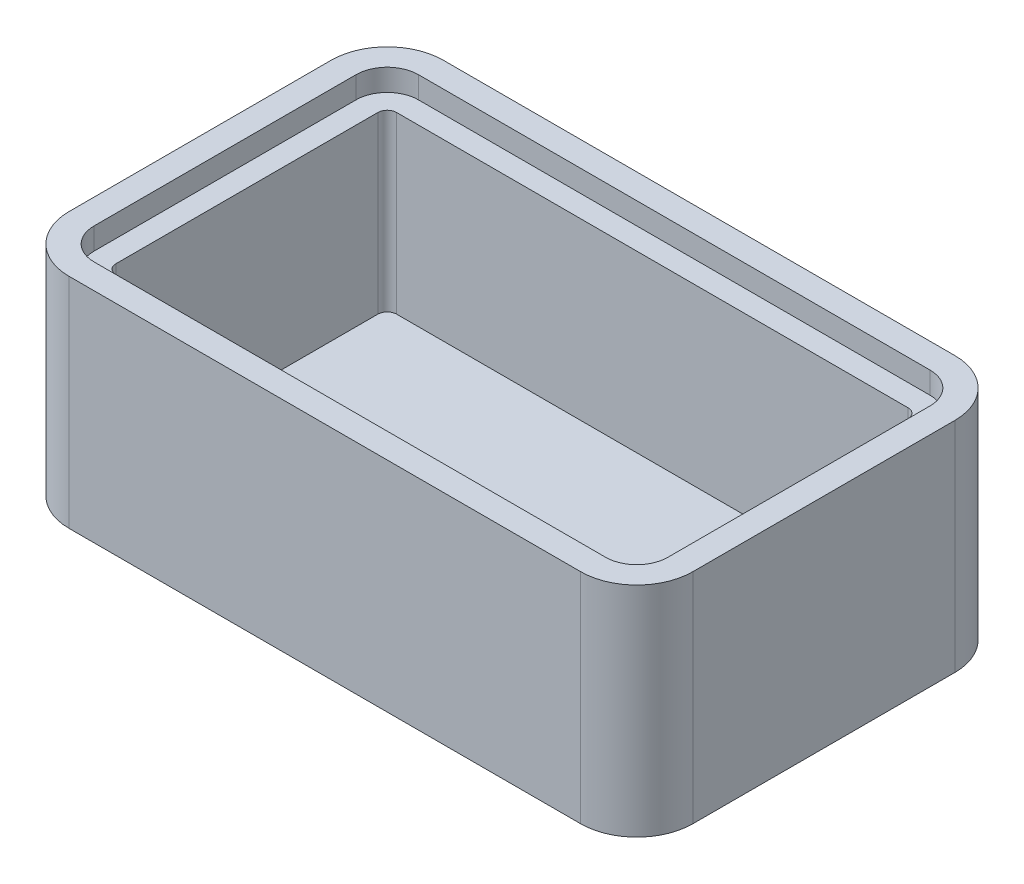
ISO-10303-21;
HEADER;
FILE_DESCRIPTION(('STEP AP214'),'2;1');
FILE_NAME('part.step','',(''),(''),'','','');
FILE_SCHEMA(('AUTOMOTIVE_DESIGN { 1 0 10303 214 1 1 1 1 }'));
ENDSEC;
DATA;
#1=APPLICATION_CONTEXT('core data for automotive mechanical design processes');
#2=APPLICATION_PROTOCOL_DEFINITION('international standard','automotive_design',2000,#1);
#3=PRODUCT_CONTEXT('',#1,'mechanical');
#4=PRODUCT('Part','Part','',(#3));
#5=PRODUCT_RELATED_PRODUCT_CATEGORY('part','',(#4));
#6=PRODUCT_DEFINITION_FORMATION('','',#4);
#7=PRODUCT_DEFINITION_CONTEXT('part definition',#1,'design');
#8=PRODUCT_DEFINITION('design','',#6,#7);
#9=PRODUCT_DEFINITION_SHAPE('','',#8);
#10=(LENGTH_UNIT() NAMED_UNIT(*) SI_UNIT(.MILLI.,.METRE.));
#11=(NAMED_UNIT(*) PLANE_ANGLE_UNIT() SI_UNIT($,.RADIAN.));
#12=(NAMED_UNIT(*) SI_UNIT($,.STERADIAN.) SOLID_ANGLE_UNIT());
#13=UNCERTAINTY_MEASURE_WITH_UNIT(LENGTH_MEASURE(1.E-05),#10,'distance_accuracy_value','');
#14=(GEOMETRIC_REPRESENTATION_CONTEXT(3) GLOBAL_UNCERTAINTY_ASSIGNED_CONTEXT((#13)) GLOBAL_UNIT_ASSIGNED_CONTEXT((#10,
#11,#12)) REPRESENTATION_CONTEXT('',''));
#15=CARTESIAN_POINT('',(0.,0.,0.));
#16=DIRECTION('',(0.,0.,1.));
#17=DIRECTION('',(1.,0.,0.));
#18=AXIS2_PLACEMENT_3D('',#15,#16,#17);
#19=CARTESIAN_POINT('',(0.,44.45,0.));
#20=DIRECTION('',(1.,0.,0.));
#21=DIRECTION('',(0.,0.,-1.));
#22=AXIS2_PLACEMENT_3D('',#19,#20,#21);
#23=PLANE('',#22);
#24=DIRECTION('',(0.,0.,1.));
#25=VECTOR('',#24,1.);
#26=CARTESIAN_POINT('',(0.,44.45,0.));
#27=LINE('',#26,#25);
#28=CARTESIAN_POINT('',(0.,44.45,-64.77));
#29=VERTEX_POINT('',#28);
#30=CARTESIAN_POINT('',(0.,44.45,-11.43));
#31=VERTEX_POINT('',#30);
#32=EDGE_CURVE('E323',#29,#31,#27,.T.);
#33=ORIENTED_EDGE('',*,*,#32,.F.);
#34=DIRECTION('',(0.,-1.,0.));
#35=VECTOR('',#34,1.);
#36=CARTESIAN_POINT('',(0.,44.45,-64.77));
#37=LINE('',#36,#35);
#38=CARTESIAN_POINT('',(0.,0.,-64.77));
#39=VERTEX_POINT('',#38);
#40=EDGE_CURVE('E12',#29,#39,#37,.T.);
#41=ORIENTED_EDGE('',*,*,#40,.T.);
#42=DIRECTION('',(0.,0.,1.));
#43=VECTOR('',#42,1.);
#44=CARTESIAN_POINT('',(0.,0.,0.));
#45=LINE('',#44,#43);
#46=CARTESIAN_POINT('',(0.,0.,-11.43));
#47=VERTEX_POINT('',#46);
#48=EDGE_CURVE('E298',#39,#47,#45,.T.);
#49=ORIENTED_EDGE('',*,*,#48,.T.);
#50=DIRECTION('',(0.,-1.,0.));
#51=VECTOR('',#50,1.);
#52=CARTESIAN_POINT('',(0.,44.45,-11.43));
#53=LINE('',#52,#51);
#54=EDGE_CURVE('E38',#47,#31,#53,.F.);
#55=ORIENTED_EDGE('',*,*,#54,.T.);
#56=EDGE_LOOP('',(#33,#41,#49,#55));
#57=FACE_BOUND('',#56,.T.);
#58=ADVANCED_FACE('F31',(#57),#23,.F.);
#59=CARTESIAN_POINT('',(0.,44.45,0.));
#60=DIRECTION('',(0.,0.,-1.));
#61=DIRECTION('',(-1.,0.,0.));
#62=AXIS2_PLACEMENT_3D('',#59,#60,#61);
#63=PLANE('',#62);
#64=DIRECTION('',(1.,0.,0.));
#65=VECTOR('',#64,1.);
#66=CARTESIAN_POINT('',(0.,0.,0.));
#67=LINE('',#66,#65);
#68=CARTESIAN_POINT('',(11.43,0.,0.));
#69=VERTEX_POINT('',#68);
#70=CARTESIAN_POINT('',(115.57,0.,0.));
#71=VERTEX_POINT('',#70);
#72=EDGE_CURVE('E314',#69,#71,#67,.T.);
#73=ORIENTED_EDGE('',*,*,#72,.T.);
#74=DIRECTION('',(0.,-1.,0.));
#75=VECTOR('',#74,1.);
#76=CARTESIAN_POINT('',(115.57,44.45,0.));
#77=LINE('',#76,#75);
#78=CARTESIAN_POINT('',(115.57,44.45,0.));
#79=VERTEX_POINT('',#78);
#80=EDGE_CURVE('E364',#71,#79,#77,.F.);
#81=ORIENTED_EDGE('',*,*,#80,.T.);
#82=DIRECTION('',(1.,0.,0.));
#83=VECTOR('',#82,1.);
#84=CARTESIAN_POINT('',(0.,44.45,0.));
#85=LINE('',#84,#83);
#86=CARTESIAN_POINT('',(11.43,44.45,0.));
#87=VERTEX_POINT('',#86);
#88=EDGE_CURVE('E326',#87,#79,#85,.T.);
#89=ORIENTED_EDGE('',*,*,#88,.F.);
#90=DIRECTION('',(0.,-1.,0.));
#91=VECTOR('',#90,1.);
#92=CARTESIAN_POINT('',(11.43,44.45,0.));
#93=LINE('',#92,#91);
#94=EDGE_CURVE('E361',#87,#69,#93,.T.);
#95=ORIENTED_EDGE('',*,*,#94,.T.);
#96=EDGE_LOOP('',(#73,#81,#89,#95));
#97=FACE_BOUND('',#96,.T.);
#98=ADVANCED_FACE('F380',(#97),#63,.F.);
#99=CARTESIAN_POINT('',(127.,44.45,0.));
#100=DIRECTION('',(-1.,0.,0.));
#101=DIRECTION('',(0.,0.,1.));
#102=AXIS2_PLACEMENT_3D('',#99,#100,#101);
#103=PLANE('',#102);
#104=DIRECTION('',(0.,0.,-1.));
#105=VECTOR('',#104,1.);
#106=CARTESIAN_POINT('',(127.,0.,0.));
#107=LINE('',#106,#105);
#108=CARTESIAN_POINT('',(127.,0.,-11.43));
#109=VERTEX_POINT('',#108);
#110=CARTESIAN_POINT('',(127.,0.,-64.77));
#111=VERTEX_POINT('',#110);
#112=EDGE_CURVE('E317',#109,#111,#107,.T.);
#113=ORIENTED_EDGE('',*,*,#112,.T.);
#114=DIRECTION('',(0.,-1.,0.));
#115=VECTOR('',#114,1.);
#116=CARTESIAN_POINT('',(127.,44.45,-64.77));
#117=LINE('',#116,#115);
#118=CARTESIAN_POINT('',(127.,44.45,-64.77));
#119=VERTEX_POINT('',#118);
#120=EDGE_CURVE('E351',#111,#119,#117,.F.);
#121=ORIENTED_EDGE('',*,*,#120,.T.);
#122=DIRECTION('',(0.,0.,-1.));
#123=VECTOR('',#122,1.);
#124=CARTESIAN_POINT('',(127.,44.45,0.));
#125=LINE('',#124,#123);
#126=CARTESIAN_POINT('',(127.,44.45,-11.43));
#127=VERTEX_POINT('',#126);
#128=EDGE_CURVE('E329',#127,#119,#125,.T.);
#129=ORIENTED_EDGE('',*,*,#128,.F.);
#130=DIRECTION('',(0.,-1.,0.));
#131=VECTOR('',#130,1.);
#132=CARTESIAN_POINT('',(127.,44.45,-11.43));
#133=LINE('',#132,#131);
#134=EDGE_CURVE('E348',#127,#109,#133,.T.);
#135=ORIENTED_EDGE('',*,*,#134,.T.);
#136=EDGE_LOOP('',(#113,#121,#129,#135));
#137=FACE_BOUND('',#136,.T.);
#138=ADVANCED_FACE('F392',(#137),#103,.F.);
#139=CARTESIAN_POINT('',(0.,44.45,-76.2));
#140=DIRECTION('',(0.,0.,1.));
#141=DIRECTION('',(1.,0.,0.));
#142=AXIS2_PLACEMENT_3D('',#139,#140,#141);
#143=PLANE('',#142);
#144=DIRECTION('',(-1.,0.,0.));
#145=VECTOR('',#144,1.);
#146=CARTESIAN_POINT('',(0.,44.45,-76.2));
#147=LINE('',#146,#145);
#148=CARTESIAN_POINT('',(115.57,44.45,-76.2));
#149=VERTEX_POINT('',#148);
#150=CARTESIAN_POINT('',(11.43,44.45,-76.2));
#151=VERTEX_POINT('',#150);
#152=EDGE_CURVE('E332',#149,#151,#147,.T.);
#153=ORIENTED_EDGE('',*,*,#152,.F.);
#154=DIRECTION('',(0.,-1.,0.));
#155=VECTOR('',#154,1.);
#156=CARTESIAN_POINT('',(115.57,44.45,-76.2));
#157=LINE('',#156,#155);
#158=CARTESIAN_POINT('',(115.57,0.,-76.2));
#159=VERTEX_POINT('',#158);
#160=EDGE_CURVE('E337',#149,#159,#157,.T.);
#161=ORIENTED_EDGE('',*,*,#160,.T.);
#162=DIRECTION('',(-1.,0.,0.));
#163=VECTOR('',#162,1.);
#164=CARTESIAN_POINT('',(0.,0.,-76.2));
#165=LINE('',#164,#163);
#166=CARTESIAN_POINT('',(11.43,0.,-76.2));
#167=VERTEX_POINT('',#166);
#168=EDGE_CURVE('E320',#159,#167,#165,.T.);
#169=ORIENTED_EDGE('',*,*,#168,.T.);
#170=DIRECTION('',(0.,-1.,0.));
#171=VECTOR('',#170,1.);
#172=CARTESIAN_POINT('',(11.43,44.45,-76.2));
#173=LINE('',#172,#171);
#174=EDGE_CURVE('E335',#167,#151,#173,.F.);
#175=ORIENTED_EDGE('',*,*,#174,.T.);
#176=EDGE_LOOP('',(#153,#161,#169,#175));
#177=FACE_BOUND('',#176,.T.);
#178=ADVANCED_FACE('F400',(#177),#143,.F.);
#179=CARTESIAN_POINT('',(0.,44.45,-76.2));
#180=DIRECTION('',(0.,-1.,0.));
#181=DIRECTION('',(0.,0.,-1.));
#182=AXIS2_PLACEMENT_3D('',#179,#180,#181);
#183=PLANE('',#182);
#184=DIRECTION('',(0.,0.,-1.));
#185=VECTOR('',#184,1.);
#186=CARTESIAN_POINT('',(121.92,44.45,-11.43));
#187=LINE('',#186,#185);
#188=CARTESIAN_POINT('',(121.92,44.45,-11.43));
#189=VERTEX_POINT('',#188);
#190=CARTESIAN_POINT('',(121.92,44.45,-64.77));
#191=VERTEX_POINT('',#190);
#192=EDGE_CURVE('E250',#189,#191,#187,.T.);
#193=ORIENTED_EDGE('',*,*,#192,.F.);
#194=CARTESIAN_POINT('',(115.57,44.45,-11.43));
#195=DIRECTION('',(0.,1.,0.));
#196=DIRECTION('',(0.,0.,1.));
#197=AXIS2_PLACEMENT_3D('',#194,#195,#196);
#198=CIRCLE('',#197,6.35);
#199=CARTESIAN_POINT('',(115.57,44.45,-5.08));
#200=VERTEX_POINT('',#199);
#201=EDGE_CURVE('E53',#200,#189,#198,.T.);
#202=ORIENTED_EDGE('',*,*,#201,.F.);
#203=DIRECTION('',(1.,0.,0.));
#204=VECTOR('',#203,1.);
#205=CARTESIAN_POINT('',(11.43,44.45,-5.08));
#206=LINE('',#205,#204);
#207=CARTESIAN_POINT('',(11.43,44.45,-5.08));
#208=VERTEX_POINT('',#207);
#209=EDGE_CURVE('E268',#208,#200,#206,.T.);
#210=ORIENTED_EDGE('',*,*,#209,.F.);
#211=CARTESIAN_POINT('',(11.43,44.45,-11.43));
#212=DIRECTION('',(0.,1.,0.));
#213=DIRECTION('',(0.,0.,1.));
#214=AXIS2_PLACEMENT_3D('',#211,#212,#213);
#215=CIRCLE('',#214,6.35);
#216=CARTESIAN_POINT('',(5.08,44.45,-11.43));
#217=VERTEX_POINT('',#216);
#218=EDGE_CURVE('E265',#217,#208,#215,.T.);
#219=ORIENTED_EDGE('',*,*,#218,.F.);
#220=DIRECTION('',(0.,0.,1.));
#221=VECTOR('',#220,1.);
#222=CARTESIAN_POINT('',(5.08,44.45,-64.77));
#223=LINE('',#222,#221);
#224=CARTESIAN_POINT('',(5.08,44.45,-64.77));
#225=VERTEX_POINT('',#224);
#226=EDGE_CURVE('E262',#225,#217,#223,.T.);
#227=ORIENTED_EDGE('',*,*,#226,.F.);
#228=CARTESIAN_POINT('',(11.43,44.45,-64.77));
#229=DIRECTION('',(0.,1.,0.));
#230=DIRECTION('',(0.,0.,1.));
#231=AXIS2_PLACEMENT_3D('',#228,#229,#230);
#232=CIRCLE('',#231,6.35);
#233=CARTESIAN_POINT('',(11.43,44.45,-71.12));
#234=VERTEX_POINT('',#233);
#235=EDGE_CURVE('E259',#234,#225,#232,.T.);
#236=ORIENTED_EDGE('',*,*,#235,.F.);
#237=DIRECTION('',(-1.,0.,0.));
#238=VECTOR('',#237,1.);
#239=CARTESIAN_POINT('',(115.57,44.45,-71.12));
#240=LINE('',#239,#238);
#241=CARTESIAN_POINT('',(115.57,44.45,-71.12));
#242=VERTEX_POINT('',#241);
#243=EDGE_CURVE('E256',#242,#234,#240,.T.);
#244=ORIENTED_EDGE('',*,*,#243,.F.);
#245=CARTESIAN_POINT('',(115.57,44.45,-64.77));
#246=DIRECTION('',(0.,1.,0.));
#247=DIRECTION('',(0.,0.,1.));
#248=AXIS2_PLACEMENT_3D('',#245,#246,#247);
#249=CIRCLE('',#248,6.34999999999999);
#250=EDGE_CURVE('E253',#191,#242,#249,.T.);
#251=ORIENTED_EDGE('',*,*,#250,.F.);
#252=EDGE_LOOP('',(#193,#202,#210,#219,#227,#236,#244,#251));
#253=FACE_BOUND('',#252,.T.);
#254=ORIENTED_EDGE('',*,*,#128,.T.);
#255=CARTESIAN_POINT('',(115.57,44.45,-64.77));
#256=DIRECTION('',(0.,-1.,0.));
#257=DIRECTION('',(0.,0.,-1.));
#258=AXIS2_PLACEMENT_3D('',#255,#256,#257);
#259=CIRCLE('',#258,11.43);
#260=EDGE_CURVE('E359',#119,#149,#259,.F.);
#261=ORIENTED_EDGE('',*,*,#260,.T.);
#262=ORIENTED_EDGE('',*,*,#152,.T.);
#263=CARTESIAN_POINT('',(11.43,44.45,-64.77));
#264=DIRECTION('',(0.,-1.,0.));
#265=DIRECTION('',(0.,0.,-1.));
#266=AXIS2_PLACEMENT_3D('',#263,#264,#265);
#267=CIRCLE('',#266,11.43);
#268=EDGE_CURVE('E355',#151,#29,#267,.F.);
#269=ORIENTED_EDGE('',*,*,#268,.T.);
#270=ORIENTED_EDGE('',*,*,#32,.T.);
#271=CARTESIAN_POINT('',(11.43,44.45,-11.43));
#272=DIRECTION('',(0.,-1.,0.));
#273=DIRECTION('',(0.,0.,-1.));
#274=AXIS2_PLACEMENT_3D('',#271,#272,#273);
#275=CIRCLE('',#274,11.43);
#276=EDGE_CURVE('E353',#31,#87,#275,.F.);
#277=ORIENTED_EDGE('',*,*,#276,.T.);
#278=ORIENTED_EDGE('',*,*,#88,.T.);
#279=CARTESIAN_POINT('',(115.57,44.45,-11.43));
#280=DIRECTION('',(0.,-1.,0.));
#281=DIRECTION('',(0.,0.,-1.));
#282=AXIS2_PLACEMENT_3D('',#279,#280,#281);
#283=CIRCLE('',#282,11.43);
#284=EDGE_CURVE('E357',#79,#127,#283,.F.);
#285=ORIENTED_EDGE('',*,*,#284,.T.);
#286=EDGE_LOOP('',(#254,#261,#262,#269,#270,#277,#278,#285));
#287=FACE_BOUND('',#286,.T.);
#288=ADVANCED_FACE('F373',(#253,#287),#183,.F.);
#289=CARTESIAN_POINT('',(0.,0.,-76.2));
#290=DIRECTION('',(0.,-1.,0.));
#291=DIRECTION('',(0.,0.,-1.));
#292=AXIS2_PLACEMENT_3D('',#289,#290,#291);
#293=PLANE('',#292);
#294=ORIENTED_EDGE('',*,*,#168,.F.);
#295=CARTESIAN_POINT('',(115.57,0.,-64.77));
#296=DIRECTION('',(0.,-1.,0.));
#297=DIRECTION('',(0.,0.,-1.));
#298=AXIS2_PLACEMENT_3D('',#295,#296,#297);
#299=CIRCLE('',#298,11.43);
#300=EDGE_CURVE('E346',#159,#111,#299,.T.);
#301=ORIENTED_EDGE('',*,*,#300,.T.);
#302=ORIENTED_EDGE('',*,*,#112,.F.);
#303=CARTESIAN_POINT('',(115.57,0.,-11.43));
#304=DIRECTION('',(0.,-1.,0.));
#305=DIRECTION('',(0.,0.,-1.));
#306=AXIS2_PLACEMENT_3D('',#303,#304,#305);
#307=CIRCLE('',#306,11.43);
#308=EDGE_CURVE('E344',#109,#71,#307,.T.);
#309=ORIENTED_EDGE('',*,*,#308,.T.);
#310=ORIENTED_EDGE('',*,*,#72,.F.);
#311=CARTESIAN_POINT('',(11.43,0.,-11.43));
#312=DIRECTION('',(0.,-1.,0.));
#313=DIRECTION('',(0.,0.,-1.));
#314=AXIS2_PLACEMENT_3D('',#311,#312,#313);
#315=CIRCLE('',#314,11.43);
#316=EDGE_CURVE('E340',#69,#47,#315,.T.);
#317=ORIENTED_EDGE('',*,*,#316,.T.);
#318=ORIENTED_EDGE('',*,*,#48,.F.);
#319=CARTESIAN_POINT('',(11.43,0.,-64.77));
#320=DIRECTION('',(0.,-1.,0.));
#321=DIRECTION('',(0.,0.,-1.));
#322=AXIS2_PLACEMENT_3D('',#319,#320,#321);
#323=CIRCLE('',#322,11.43);
#324=EDGE_CURVE('E342',#39,#167,#323,.T.);
#325=ORIENTED_EDGE('',*,*,#324,.T.);
#326=EDGE_LOOP('',(#294,#301,#302,#309,#310,#317,#318,#325));
#327=FACE_BOUND('',#326,.T.);
#328=ADVANCED_FACE('F384',(#327),#293,.T.);
#329=CARTESIAN_POINT('',(115.57,44.45,-64.77));
#330=DIRECTION('',(0.,-1.,0.));
#331=DIRECTION('',(0.,0.,-1.));
#332=AXIS2_PLACEMENT_3D('',#329,#330,#331);
#333=CYLINDRICAL_SURFACE('',#332,11.43);
#334=ORIENTED_EDGE('',*,*,#260,.F.);
#335=ORIENTED_EDGE('',*,*,#120,.F.);
#336=ORIENTED_EDGE('',*,*,#300,.F.);
#337=ORIENTED_EDGE('',*,*,#160,.F.);
#338=EDGE_LOOP('',(#334,#335,#336,#337));
#339=FACE_BOUND('',#338,.T.);
#340=ADVANCED_FACE('F398',(#339),#333,.T.);
#341=CARTESIAN_POINT('',(115.57,44.45,-11.43));
#342=DIRECTION('',(0.,-1.,0.));
#343=DIRECTION('',(0.,0.,-1.));
#344=AXIS2_PLACEMENT_3D('',#341,#342,#343);
#345=CYLINDRICAL_SURFACE('',#344,11.43);
#346=ORIENTED_EDGE('',*,*,#284,.F.);
#347=ORIENTED_EDGE('',*,*,#80,.F.);
#348=ORIENTED_EDGE('',*,*,#308,.F.);
#349=ORIENTED_EDGE('',*,*,#134,.F.);
#350=EDGE_LOOP('',(#346,#347,#348,#349));
#351=FACE_BOUND('',#350,.T.);
#352=ADVANCED_FACE('F389',(#351),#345,.T.);
#353=CARTESIAN_POINT('',(11.43,44.45,-64.77));
#354=DIRECTION('',(0.,-1.,0.));
#355=DIRECTION('',(0.,0.,-1.));
#356=AXIS2_PLACEMENT_3D('',#353,#354,#355);
#357=CYLINDRICAL_SURFACE('',#356,11.43);
#358=ORIENTED_EDGE('',*,*,#268,.F.);
#359=ORIENTED_EDGE('',*,*,#174,.F.);
#360=ORIENTED_EDGE('',*,*,#324,.F.);
#361=ORIENTED_EDGE('',*,*,#40,.F.);
#362=EDGE_LOOP('',(#358,#359,#360,#361));
#363=FACE_BOUND('',#362,.T.);
#364=ADVANCED_FACE('F403',(#363),#357,.T.);
#365=CARTESIAN_POINT('',(11.43,44.45,-11.43));
#366=DIRECTION('',(0.,-1.,0.));
#367=DIRECTION('',(0.,0.,-1.));
#368=AXIS2_PLACEMENT_3D('',#365,#366,#367);
#369=CYLINDRICAL_SURFACE('',#368,11.43);
#370=ORIENTED_EDGE('',*,*,#276,.F.);
#371=ORIENTED_EDGE('',*,*,#54,.F.);
#372=ORIENTED_EDGE('',*,*,#316,.F.);
#373=ORIENTED_EDGE('',*,*,#94,.F.);
#374=EDGE_LOOP('',(#370,#371,#372,#373));
#375=FACE_BOUND('',#374,.T.);
#376=ADVANCED_FACE('F377',(#375),#369,.T.);
#377=CARTESIAN_POINT('',(115.57,40.005,-11.43));
#378=DIRECTION('',(0.,1.,0.));
#379=DIRECTION('',(0.,0.,1.));
#380=AXIS2_PLACEMENT_3D('',#377,#378,#379);
#381=CYLINDRICAL_SURFACE('',#380,6.35);
#382=ORIENTED_EDGE('',*,*,#201,.T.);
#383=DIRECTION('',(0.,1.,0.));
#384=VECTOR('',#383,1.);
#385=CARTESIAN_POINT('',(121.92,40.005,-11.43));
#386=LINE('',#385,#384);
#387=CARTESIAN_POINT('',(121.92,40.005,-11.43));
#388=VERTEX_POINT('',#387);
#389=EDGE_CURVE('E295',#388,#189,#386,.T.);
#390=ORIENTED_EDGE('',*,*,#389,.F.);
#391=CARTESIAN_POINT('',(115.57,40.005,-11.43));
#392=DIRECTION('',(0.,1.,0.));
#393=DIRECTION('',(0.,0.,1.));
#394=AXIS2_PLACEMENT_3D('',#391,#392,#393);
#395=CIRCLE('',#394,6.35);
#396=CARTESIAN_POINT('',(115.57,40.005,-5.08));
#397=VERTEX_POINT('',#396);
#398=EDGE_CURVE('E271',#397,#388,#395,.T.);
#399=ORIENTED_EDGE('',*,*,#398,.F.);
#400=DIRECTION('',(0.,1.,0.));
#401=VECTOR('',#400,1.);
#402=CARTESIAN_POINT('',(115.57,40.005,-5.08));
#403=LINE('',#402,#401);
#404=EDGE_CURVE('E296',#397,#200,#403,.T.);
#405=ORIENTED_EDGE('',*,*,#404,.T.);
#406=EDGE_LOOP('',(#382,#390,#399,#405));
#407=FACE_BOUND('',#406,.T.);
#408=ADVANCED_FACE('F410',(#407),#381,.F.);
#409=CARTESIAN_POINT('',(11.43,40.005,-5.08));
#410=DIRECTION('',(0.,0.,1.));
#411=DIRECTION('',(1.,0.,0.));
#412=AXIS2_PLACEMENT_3D('',#409,#410,#411);
#413=PLANE('',#412);
#414=ORIENTED_EDGE('',*,*,#209,.T.);
#415=ORIENTED_EDGE('',*,*,#404,.F.);
#416=DIRECTION('',(1.,0.,0.));
#417=VECTOR('',#416,1.);
#418=CARTESIAN_POINT('',(11.43,40.005,-5.08));
#419=LINE('',#418,#417);
#420=CARTESIAN_POINT('',(11.43,40.005,-5.08));
#421=VERTEX_POINT('',#420);
#422=EDGE_CURVE('E292',#421,#397,#419,.T.);
#423=ORIENTED_EDGE('',*,*,#422,.F.);
#424=DIRECTION('',(0.,1.,0.));
#425=VECTOR('',#424,1.);
#426=CARTESIAN_POINT('',(11.43,40.005,-5.08));
#427=LINE('',#426,#425);
#428=EDGE_CURVE('E299',#421,#208,#427,.T.);
#429=ORIENTED_EDGE('',*,*,#428,.T.);
#430=EDGE_LOOP('',(#414,#415,#423,#429));
#431=FACE_BOUND('',#430,.T.);
#432=ADVANCED_FACE('F451',(#431),#413,.F.);
#433=CARTESIAN_POINT('',(11.43,40.005,-11.43));
#434=DIRECTION('',(0.,1.,0.));
#435=DIRECTION('',(0.,0.,1.));
#436=AXIS2_PLACEMENT_3D('',#433,#434,#435);
#437=CYLINDRICAL_SURFACE('',#436,6.35);
#438=ORIENTED_EDGE('',*,*,#218,.T.);
#439=ORIENTED_EDGE('',*,*,#428,.F.);
#440=CARTESIAN_POINT('',(11.43,40.005,-11.43));
#441=DIRECTION('',(0.,1.,0.));
#442=DIRECTION('',(0.,0.,1.));
#443=AXIS2_PLACEMENT_3D('',#440,#441,#442);
#444=CIRCLE('',#443,6.35);
#445=CARTESIAN_POINT('',(5.08,40.005,-11.43));
#446=VERTEX_POINT('',#445);
#447=EDGE_CURVE('E289',#446,#421,#444,.T.);
#448=ORIENTED_EDGE('',*,*,#447,.F.);
#449=DIRECTION('',(0.,1.,0.));
#450=VECTOR('',#449,1.);
#451=CARTESIAN_POINT('',(5.08,40.005,-11.43));
#452=LINE('',#451,#450);
#453=EDGE_CURVE('E301',#446,#217,#452,.T.);
#454=ORIENTED_EDGE('',*,*,#453,.T.);
#455=EDGE_LOOP('',(#438,#439,#448,#454));
#456=FACE_BOUND('',#455,.T.);
#457=ADVANCED_FACE('F458',(#456),#437,.F.);
#458=CARTESIAN_POINT('',(5.08,40.005,-64.77));
#459=DIRECTION('',(-1.,0.,0.));
#460=DIRECTION('',(0.,0.,1.));
#461=AXIS2_PLACEMENT_3D('',#458,#459,#460);
#462=PLANE('',#461);
#463=ORIENTED_EDGE('',*,*,#226,.T.);
#464=ORIENTED_EDGE('',*,*,#453,.F.);
#465=DIRECTION('',(0.,0.,1.));
#466=VECTOR('',#465,1.);
#467=CARTESIAN_POINT('',(5.08,40.005,-64.77));
#468=LINE('',#467,#466);
#469=CARTESIAN_POINT('',(5.08,40.005,-64.77));
#470=VERTEX_POINT('',#469);
#471=EDGE_CURVE('E286',#470,#446,#468,.T.);
#472=ORIENTED_EDGE('',*,*,#471,.F.);
#473=DIRECTION('',(0.,1.,0.));
#474=VECTOR('',#473,1.);
#475=CARTESIAN_POINT('',(5.08,40.005,-64.77));
#476=LINE('',#475,#474);
#477=EDGE_CURVE('E303',#470,#225,#476,.T.);
#478=ORIENTED_EDGE('',*,*,#477,.T.);
#479=EDGE_LOOP('',(#463,#464,#472,#478));
#480=FACE_BOUND('',#479,.T.);
#481=ADVANCED_FACE('F466',(#480),#462,.F.);
#482=CARTESIAN_POINT('',(11.43,40.005,-64.77));
#483=DIRECTION('',(0.,1.,0.));
#484=DIRECTION('',(0.,0.,1.));
#485=AXIS2_PLACEMENT_3D('',#482,#483,#484);
#486=CYLINDRICAL_SURFACE('',#485,6.35);
#487=ORIENTED_EDGE('',*,*,#235,.T.);
#488=ORIENTED_EDGE('',*,*,#477,.F.);
#489=CARTESIAN_POINT('',(11.43,40.005,-64.77));
#490=DIRECTION('',(0.,1.,0.));
#491=DIRECTION('',(0.,0.,1.));
#492=AXIS2_PLACEMENT_3D('',#489,#490,#491);
#493=CIRCLE('',#492,6.35);
#494=CARTESIAN_POINT('',(11.43,40.005,-71.12));
#495=VERTEX_POINT('',#494);
#496=EDGE_CURVE('E283',#495,#470,#493,.T.);
#497=ORIENTED_EDGE('',*,*,#496,.F.);
#498=DIRECTION('',(0.,1.,0.));
#499=VECTOR('',#498,1.);
#500=CARTESIAN_POINT('',(11.43,40.005,-71.12));
#501=LINE('',#500,#499);
#502=EDGE_CURVE('E305',#495,#234,#501,.T.);
#503=ORIENTED_EDGE('',*,*,#502,.T.);
#504=EDGE_LOOP('',(#487,#488,#497,#503));
#505=FACE_BOUND('',#504,.T.);
#506=ADVANCED_FACE('F474',(#505),#486,.F.);
#507=CARTESIAN_POINT('',(115.57,40.005,-71.12));
#508=DIRECTION('',(0.,0.,-1.));
#509=DIRECTION('',(-1.,0.,0.));
#510=AXIS2_PLACEMENT_3D('',#507,#508,#509);
#511=PLANE('',#510);
#512=ORIENTED_EDGE('',*,*,#243,.T.);
#513=ORIENTED_EDGE('',*,*,#502,.F.);
#514=DIRECTION('',(-1.,0.,0.));
#515=VECTOR('',#514,1.);
#516=CARTESIAN_POINT('',(115.57,40.005,-71.12));
#517=LINE('',#516,#515);
#518=CARTESIAN_POINT('',(115.57,40.005,-71.12));
#519=VERTEX_POINT('',#518);
#520=EDGE_CURVE('E280',#519,#495,#517,.T.);
#521=ORIENTED_EDGE('',*,*,#520,.F.);
#522=DIRECTION('',(0.,1.,0.));
#523=VECTOR('',#522,1.);
#524=CARTESIAN_POINT('',(115.57,40.005,-71.12));
#525=LINE('',#524,#523);
#526=EDGE_CURVE('E307',#519,#242,#525,.T.);
#527=ORIENTED_EDGE('',*,*,#526,.T.);
#528=EDGE_LOOP('',(#512,#513,#521,#527));
#529=FACE_BOUND('',#528,.T.);
#530=ADVANCED_FACE('F482',(#529),#511,.F.);
#531=CARTESIAN_POINT('',(115.57,40.005,-64.77));
#532=DIRECTION('',(0.,1.,0.));
#533=DIRECTION('',(0.,0.,1.));
#534=AXIS2_PLACEMENT_3D('',#531,#532,#533);
#535=CYLINDRICAL_SURFACE('',#534,6.34999999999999);
#536=ORIENTED_EDGE('',*,*,#250,.T.);
#537=ORIENTED_EDGE('',*,*,#526,.F.);
#538=CARTESIAN_POINT('',(115.57,40.005,-64.77));
#539=DIRECTION('',(0.,1.,0.));
#540=DIRECTION('',(0.,0.,1.));
#541=AXIS2_PLACEMENT_3D('',#538,#539,#540);
#542=CIRCLE('',#541,6.34999999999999);
#543=CARTESIAN_POINT('',(121.92,40.005,-64.77));
#544=VERTEX_POINT('',#543);
#545=EDGE_CURVE('E277',#544,#519,#542,.T.);
#546=ORIENTED_EDGE('',*,*,#545,.F.);
#547=DIRECTION('',(0.,1.,0.));
#548=VECTOR('',#547,1.);
#549=CARTESIAN_POINT('',(121.92,40.005,-64.77));
#550=LINE('',#549,#548);
#551=EDGE_CURVE('E309',#544,#191,#550,.T.);
#552=ORIENTED_EDGE('',*,*,#551,.T.);
#553=EDGE_LOOP('',(#536,#537,#546,#552));
#554=FACE_BOUND('',#553,.T.);
#555=ADVANCED_FACE('F490',(#554),#535,.F.);
#556=CARTESIAN_POINT('',(121.92,40.005,-11.43));
#557=DIRECTION('',(1.,0.,0.));
#558=DIRECTION('',(0.,0.,-1.));
#559=AXIS2_PLACEMENT_3D('',#556,#557,#558);
#560=PLANE('',#559);
#561=ORIENTED_EDGE('',*,*,#192,.T.);
#562=ORIENTED_EDGE('',*,*,#551,.F.);
#563=DIRECTION('',(0.,0.,-1.));
#564=VECTOR('',#563,1.);
#565=CARTESIAN_POINT('',(121.92,40.005,-11.43));
#566=LINE('',#565,#564);
#567=EDGE_CURVE('E274',#388,#544,#566,.T.);
#568=ORIENTED_EDGE('',*,*,#567,.F.);
#569=ORIENTED_EDGE('',*,*,#389,.T.);
#570=EDGE_LOOP('',(#561,#562,#568,#569));
#571=FACE_BOUND('',#570,.T.);
#572=ADVANCED_FACE('F498',(#571),#560,.F.);
#573=CARTESIAN_POINT('',(115.57,40.005,-11.43));
#574=DIRECTION('',(0.,1.,0.));
#575=DIRECTION('',(0.,0.,1.));
#576=AXIS2_PLACEMENT_3D('',#573,#574,#575);
#577=PLANE('',#576);
#578=DIRECTION('',(0.,0.,-1.));
#579=VECTOR('',#578,1.);
#580=CARTESIAN_POINT('',(117.475,40.005,-11.43));
#581=LINE('',#580,#579);
#582=CARTESIAN_POINT('',(117.475,40.005,-11.43));
#583=VERTEX_POINT('',#582);
#584=CARTESIAN_POINT('',(117.475,40.005,-64.77));
#585=VERTEX_POINT('',#584);
#586=EDGE_CURVE('E208',#583,#585,#581,.T.);
#587=ORIENTED_EDGE('',*,*,#586,.F.);
#588=CARTESIAN_POINT('',(115.57,40.005,-11.43));
#589=DIRECTION('',(0.,1.,0.));
#590=DIRECTION('',(0.,0.,1.));
#591=AXIS2_PLACEMENT_3D('',#588,#589,#590);
#592=CIRCLE('',#591,1.905);
#593=CARTESIAN_POINT('',(115.57,40.005,-9.525));
#594=VERTEX_POINT('',#593);
#595=EDGE_CURVE('E220',#594,#583,#592,.T.);
#596=ORIENTED_EDGE('',*,*,#595,.F.);
#597=DIRECTION('',(1.,0.,0.));
#598=VECTOR('',#597,1.);
#599=CARTESIAN_POINT('',(11.43,40.005,-9.525));
#600=LINE('',#599,#598);
#601=CARTESIAN_POINT('',(11.43,40.005,-9.525));
#602=VERTEX_POINT('',#601);
#603=EDGE_CURVE('E45',#602,#594,#600,.T.);
#604=ORIENTED_EDGE('',*,*,#603,.F.);
#605=CARTESIAN_POINT('',(11.43,40.005,-11.43));
#606=DIRECTION('',(0.,1.,0.));
#607=DIRECTION('',(0.,0.,1.));
#608=AXIS2_PLACEMENT_3D('',#605,#606,#607);
#609=CIRCLE('',#608,1.905);
#610=CARTESIAN_POINT('',(9.525,40.005,-11.43));
#611=VERTEX_POINT('',#610);
#612=EDGE_CURVE('E216',#611,#602,#609,.T.);
#613=ORIENTED_EDGE('',*,*,#612,.F.);
#614=DIRECTION('',(0.,0.,1.));
#615=VECTOR('',#614,1.);
#616=CARTESIAN_POINT('',(9.525,40.005,-64.77));
#617=LINE('',#616,#615);
#618=CARTESIAN_POINT('',(9.525,40.005,-64.77));
#619=VERTEX_POINT('',#618);
#620=EDGE_CURVE('E594',#619,#611,#617,.T.);
#621=ORIENTED_EDGE('',*,*,#620,.F.);
#622=CARTESIAN_POINT('',(11.43,40.005,-64.77));
#623=DIRECTION('',(0.,1.,0.));
#624=DIRECTION('',(0.,0.,1.));
#625=AXIS2_PLACEMENT_3D('',#622,#623,#624);
#626=CIRCLE('',#625,1.90499999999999);
#627=CARTESIAN_POINT('',(11.43,40.005,-66.675));
#628=VERTEX_POINT('',#627);
#629=EDGE_CURVE('E591',#628,#619,#626,.T.);
#630=ORIENTED_EDGE('',*,*,#629,.F.);
#631=DIRECTION('',(-1.,0.,0.));
#632=VECTOR('',#631,1.);
#633=CARTESIAN_POINT('',(115.57,40.005,-66.675));
#634=LINE('',#633,#632);
#635=CARTESIAN_POINT('',(115.57,40.005,-66.675));
#636=VERTEX_POINT('',#635);
#637=EDGE_CURVE('E586',#636,#628,#634,.T.);
#638=ORIENTED_EDGE('',*,*,#637,.F.);
#639=CARTESIAN_POINT('',(115.57,40.005,-64.77));
#640=DIRECTION('',(0.,1.,0.));
#641=DIRECTION('',(0.,0.,1.));
#642=AXIS2_PLACEMENT_3D('',#639,#640,#641);
#643=CIRCLE('',#642,1.90499999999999);
#644=EDGE_CURVE('E585',#585,#636,#643,.T.);
#645=ORIENTED_EDGE('',*,*,#644,.F.);
#646=EDGE_LOOP('',(#587,#596,#604,#613,#621,#630,#638,#645));
#647=FACE_BOUND('',#646,.T.);
#648=ORIENTED_EDGE('',*,*,#398,.T.);
#649=ORIENTED_EDGE('',*,*,#567,.T.);
#650=ORIENTED_EDGE('',*,*,#545,.T.);
#651=ORIENTED_EDGE('',*,*,#520,.T.);
#652=ORIENTED_EDGE('',*,*,#496,.T.);
#653=ORIENTED_EDGE('',*,*,#471,.T.);
#654=ORIENTED_EDGE('',*,*,#447,.T.);
#655=ORIENTED_EDGE('',*,*,#422,.T.);
#656=EDGE_LOOP('',(#648,#649,#650,#651,#652,#653,#654,#655));
#657=FACE_BOUND('',#656,.T.);
#658=ADVANCED_FACE('F506',(#647,#657),#577,.T.);
#659=CARTESIAN_POINT('',(0.,4.445,-76.2));
#660=DIRECTION('',(0.,-1.,0.));
#661=DIRECTION('',(0.,0.,-1.));
#662=AXIS2_PLACEMENT_3D('',#659,#660,#661);
#663=PLANE('',#662);
#664=CARTESIAN_POINT('',(115.57,4.44499999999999,-11.43));
#665=DIRECTION('',(0.,-1.,0.));
#666=DIRECTION('',(0.,0.,-1.));
#667=AXIS2_PLACEMENT_3D('',#664,#665,#666);
#668=CIRCLE('',#667,1.905);
#669=CARTESIAN_POINT('',(115.57,4.44499999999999,-9.525));
#670=VERTEX_POINT('',#669);
#671=CARTESIAN_POINT('',(117.475,4.44499999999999,-11.43));
#672=VERTEX_POINT('',#671);
#673=EDGE_CURVE('E213',#670,#672,#668,.F.);
#674=ORIENTED_EDGE('',*,*,#673,.T.);
#675=DIRECTION('',(0.,0.,-1.));
#676=VECTOR('',#675,1.);
#677=CARTESIAN_POINT('',(117.475,4.44499999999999,-11.43));
#678=LINE('',#677,#676);
#679=CARTESIAN_POINT('',(117.475,4.44499999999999,-64.77));
#680=VERTEX_POINT('',#679);
#681=EDGE_CURVE('E205',#672,#680,#678,.T.);
#682=ORIENTED_EDGE('',*,*,#681,.T.);
#683=CARTESIAN_POINT('',(115.57,4.44499999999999,-64.77));
#684=DIRECTION('',(0.,-1.,0.));
#685=DIRECTION('',(0.,0.,-1.));
#686=AXIS2_PLACEMENT_3D('',#683,#684,#685);
#687=CIRCLE('',#686,1.90499999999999);
#688=CARTESIAN_POINT('',(115.57,4.44499999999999,-66.675));
#689=VERTEX_POINT('',#688);
#690=EDGE_CURVE('E192',#680,#689,#687,.F.);
#691=ORIENTED_EDGE('',*,*,#690,.T.);
#692=DIRECTION('',(-1.,0.,0.));
#693=VECTOR('',#692,1.);
#694=CARTESIAN_POINT('',(115.57,4.44499999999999,-66.675));
#695=LINE('',#694,#693);
#696=CARTESIAN_POINT('',(11.43,4.44499999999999,-66.675));
#697=VERTEX_POINT('',#696);
#698=EDGE_CURVE('E240',#689,#697,#695,.T.);
#699=ORIENTED_EDGE('',*,*,#698,.T.);
#700=CARTESIAN_POINT('',(11.43,4.44499999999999,-64.77));
#701=DIRECTION('',(0.,-1.,0.));
#702=DIRECTION('',(0.,0.,-1.));
#703=AXIS2_PLACEMENT_3D('',#700,#701,#702);
#704=CIRCLE('',#703,1.90499999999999);
#705=CARTESIAN_POINT('',(9.52500000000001,4.44499999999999,-64.77));
#706=VERTEX_POINT('',#705);
#707=EDGE_CURVE('E236',#697,#706,#704,.F.);
#708=ORIENTED_EDGE('',*,*,#707,.T.);
#709=DIRECTION('',(0.,0.,1.));
#710=VECTOR('',#709,1.);
#711=CARTESIAN_POINT('',(9.525,4.44499999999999,-64.77));
#712=LINE('',#711,#710);
#713=CARTESIAN_POINT('',(9.525,4.44499999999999,-11.43));
#714=VERTEX_POINT('',#713);
#715=EDGE_CURVE('E232',#706,#714,#712,.T.);
#716=ORIENTED_EDGE('',*,*,#715,.T.);
#717=CARTESIAN_POINT('',(11.43,4.44499999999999,-11.43));
#718=DIRECTION('',(0.,-1.,0.));
#719=DIRECTION('',(0.,0.,-1.));
#720=AXIS2_PLACEMENT_3D('',#717,#718,#719);
#721=CIRCLE('',#720,1.905);
#722=CARTESIAN_POINT('',(11.43,4.44499999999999,-9.525));
#723=VERTEX_POINT('',#722);
#724=EDGE_CURVE('E228',#714,#723,#721,.F.);
#725=ORIENTED_EDGE('',*,*,#724,.T.);
#726=DIRECTION('',(1.,0.,0.));
#727=VECTOR('',#726,1.);
#728=CARTESIAN_POINT('',(11.43,4.44499999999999,-9.525));
#729=LINE('',#728,#727);
#730=EDGE_CURVE('E225',#723,#670,#729,.T.);
#731=ORIENTED_EDGE('',*,*,#730,.T.);
#732=EDGE_LOOP('',(#674,#682,#691,#699,#708,#716,#725,#731));
#733=FACE_BOUND('',#732,.T.);
#734=ADVANCED_FACE('F211',(#733),#663,.F.);
#735=CARTESIAN_POINT('',(117.475,-122.144688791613,-11.43));
#736=DIRECTION('',(1.,0.,0.));
#737=DIRECTION('',(0.,0.,-1.));
#738=AXIS2_PLACEMENT_3D('',#735,#736,#737);
#739=PLANE('',#738);
#740=DIRECTION('',(0.,1.,0.));
#741=VECTOR('',#740,1.);
#742=CARTESIAN_POINT('',(117.475,-122.144688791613,-11.43));
#743=LINE('',#742,#741);
#744=EDGE_CURVE('E223',#672,#583,#743,.T.);
#745=ORIENTED_EDGE('',*,*,#744,.T.);
#746=ORIENTED_EDGE('',*,*,#586,.T.);
#747=DIRECTION('',(0.,1.,0.));
#748=VECTOR('',#747,1.);
#749=CARTESIAN_POINT('',(117.475,-122.144688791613,-64.77));
#750=LINE('',#749,#748);
#751=EDGE_CURVE('E196',#680,#585,#750,.T.);
#752=ORIENTED_EDGE('',*,*,#751,.F.);
#753=ORIENTED_EDGE('',*,*,#681,.F.);
#754=EDGE_LOOP('',(#745,#746,#752,#753));
#755=FACE_BOUND('',#754,.T.);
#756=ADVANCED_FACE('F204',(#755),#739,.F.);
#757=CARTESIAN_POINT('',(115.57,-122.144688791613,-64.77));
#758=DIRECTION('',(0.,1.,0.));
#759=DIRECTION('',(0.,0.,1.));
#760=AXIS2_PLACEMENT_3D('',#757,#758,#759);
#761=CYLINDRICAL_SURFACE('',#760,1.90499999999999);
#762=ORIENTED_EDGE('',*,*,#751,.T.);
#763=ORIENTED_EDGE('',*,*,#644,.T.);
#764=DIRECTION('',(0.,1.,0.));
#765=VECTOR('',#764,1.);
#766=CARTESIAN_POINT('',(115.57,-122.144688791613,-66.675));
#767=LINE('',#766,#765);
#768=EDGE_CURVE('E198',#689,#636,#767,.T.);
#769=ORIENTED_EDGE('',*,*,#768,.F.);
#770=ORIENTED_EDGE('',*,*,#690,.F.);
#771=EDGE_LOOP('',(#762,#763,#769,#770));
#772=FACE_BOUND('',#771,.T.);
#773=ADVANCED_FACE('F194',(#772),#761,.F.);
#774=CARTESIAN_POINT('',(115.57,-122.144688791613,-66.675));
#775=DIRECTION('',(0.,0.,-1.));
#776=DIRECTION('',(-1.,0.,0.));
#777=AXIS2_PLACEMENT_3D('',#774,#775,#776);
#778=PLANE('',#777);
#779=ORIENTED_EDGE('',*,*,#768,.T.);
#780=ORIENTED_EDGE('',*,*,#637,.T.);
#781=DIRECTION('',(0.,1.,0.));
#782=VECTOR('',#781,1.);
#783=CARTESIAN_POINT('',(11.43,-122.144688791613,-66.675));
#784=LINE('',#783,#782);
#785=EDGE_CURVE('E239',#697,#628,#784,.T.);
#786=ORIENTED_EDGE('',*,*,#785,.F.);
#787=ORIENTED_EDGE('',*,*,#698,.F.);
#788=EDGE_LOOP('',(#779,#780,#786,#787));
#789=FACE_BOUND('',#788,.T.);
#790=ADVANCED_FACE('F533',(#789),#778,.F.);
#791=CARTESIAN_POINT('',(11.43,-122.144688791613,-64.77));
#792=DIRECTION('',(0.,1.,0.));
#793=DIRECTION('',(0.,0.,1.));
#794=AXIS2_PLACEMENT_3D('',#791,#792,#793);
#795=CYLINDRICAL_SURFACE('',#794,1.90499999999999);
#796=ORIENTED_EDGE('',*,*,#785,.T.);
#797=ORIENTED_EDGE('',*,*,#629,.T.);
#798=DIRECTION('',(0.,1.,0.));
#799=VECTOR('',#798,1.);
#800=CARTESIAN_POINT('',(9.525,-122.144688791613,-64.77));
#801=LINE('',#800,#799);
#802=EDGE_CURVE('E235',#706,#619,#801,.T.);
#803=ORIENTED_EDGE('',*,*,#802,.F.);
#804=ORIENTED_EDGE('',*,*,#707,.F.);
#805=EDGE_LOOP('',(#796,#797,#803,#804));
#806=FACE_BOUND('',#805,.T.);
#807=ADVANCED_FACE('F540',(#806),#795,.F.);
#808=CARTESIAN_POINT('',(9.525,-122.144688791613,-64.77));
#809=DIRECTION('',(-1.,0.,0.));
#810=DIRECTION('',(0.,0.,1.));
#811=AXIS2_PLACEMENT_3D('',#808,#809,#810);
#812=PLANE('',#811);
#813=ORIENTED_EDGE('',*,*,#802,.T.);
#814=ORIENTED_EDGE('',*,*,#620,.T.);
#815=DIRECTION('',(0.,1.,0.));
#816=VECTOR('',#815,1.);
#817=CARTESIAN_POINT('',(9.525,-122.144688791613,-11.43));
#818=LINE('',#817,#816);
#819=EDGE_CURVE('E231',#714,#611,#818,.T.);
#820=ORIENTED_EDGE('',*,*,#819,.F.);
#821=ORIENTED_EDGE('',*,*,#715,.F.);
#822=EDGE_LOOP('',(#813,#814,#820,#821));
#823=FACE_BOUND('',#822,.T.);
#824=ADVANCED_FACE('F548',(#823),#812,.F.);
#825=CARTESIAN_POINT('',(11.43,-122.144688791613,-11.43));
#826=DIRECTION('',(0.,1.,0.));
#827=DIRECTION('',(0.,0.,1.));
#828=AXIS2_PLACEMENT_3D('',#825,#826,#827);
#829=CYLINDRICAL_SURFACE('',#828,1.905);
#830=ORIENTED_EDGE('',*,*,#819,.T.);
#831=ORIENTED_EDGE('',*,*,#612,.T.);
#832=DIRECTION('',(0.,1.,0.));
#833=VECTOR('',#832,1.);
#834=CARTESIAN_POINT('',(11.43,-122.144688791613,-9.525));
#835=LINE('',#834,#833);
#836=EDGE_CURVE('E227',#723,#602,#835,.T.);
#837=ORIENTED_EDGE('',*,*,#836,.F.);
#838=ORIENTED_EDGE('',*,*,#724,.F.);
#839=EDGE_LOOP('',(#830,#831,#837,#838));
#840=FACE_BOUND('',#839,.T.);
#841=ADVANCED_FACE('F556',(#840),#829,.F.);
#842=CARTESIAN_POINT('',(11.43,-122.144688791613,-9.525));
#843=DIRECTION('',(0.,0.,1.));
#844=DIRECTION('',(1.,0.,0.));
#845=AXIS2_PLACEMENT_3D('',#842,#843,#844);
#846=PLANE('',#845);
#847=ORIENTED_EDGE('',*,*,#836,.T.);
#848=ORIENTED_EDGE('',*,*,#603,.T.);
#849=DIRECTION('',(0.,1.,0.));
#850=VECTOR('',#849,1.);
#851=CARTESIAN_POINT('',(115.57,-122.144688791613,-9.525));
#852=LINE('',#851,#850);
#853=EDGE_CURVE('E224',#670,#594,#852,.T.);
#854=ORIENTED_EDGE('',*,*,#853,.F.);
#855=ORIENTED_EDGE('',*,*,#730,.F.);
#856=EDGE_LOOP('',(#847,#848,#854,#855));
#857=FACE_BOUND('',#856,.T.);
#858=ADVANCED_FACE('F564',(#857),#846,.F.);
#859=CARTESIAN_POINT('',(115.57,-122.144688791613,-11.43));
#860=DIRECTION('',(0.,1.,0.));
#861=DIRECTION('',(0.,0.,1.));
#862=AXIS2_PLACEMENT_3D('',#859,#860,#861);
#863=CYLINDRICAL_SURFACE('',#862,1.905);
#864=ORIENTED_EDGE('',*,*,#853,.T.);
#865=ORIENTED_EDGE('',*,*,#595,.T.);
#866=ORIENTED_EDGE('',*,*,#744,.F.);
#867=ORIENTED_EDGE('',*,*,#673,.F.);
#868=EDGE_LOOP('',(#864,#865,#866,#867));
#869=FACE_BOUND('',#868,.T.);
#870=ADVANCED_FACE('F572',(#869),#863,.F.);
#871=CLOSED_SHELL('',(#58,#98,#138,#178,#288,#328,#340,#352,#364,#376,#408,#432,#457,#481,#506,
#530,#555,#572,#658,#734,#756,#773,#790,#807,#824,#841,#858,#870));
#872=MANIFOLD_SOLID_BREP('B2',#871);
#873=ADVANCED_BREP_SHAPE_REPRESENTATION('',(#18,#872),#14);
#874=SHAPE_DEFINITION_REPRESENTATION(#9,#873);
ENDSEC;
END-ISO-10303-21;
